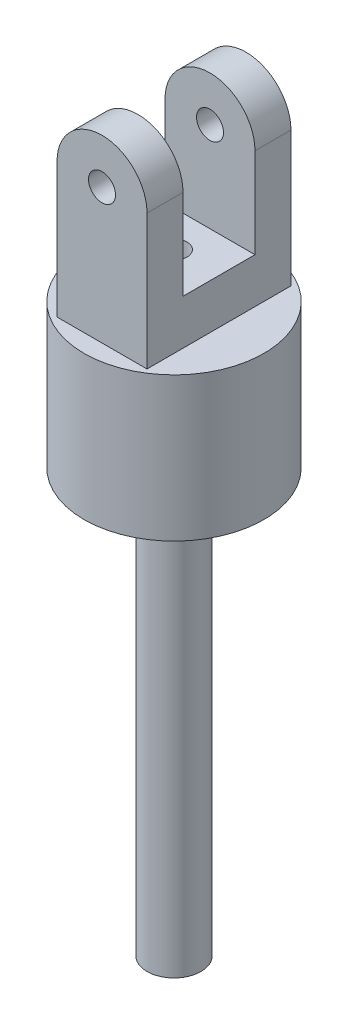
ISO-10303-21;
HEADER;
FILE_DESCRIPTION(('STEP AP214'),'2;1');
FILE_NAME('part.step','',(''),(''),'','','');
FILE_SCHEMA(('AUTOMOTIVE_DESIGN { 1 0 10303 214 1 1 1 1 }'));
ENDSEC;
DATA;
#1=APPLICATION_CONTEXT('core data for automotive mechanical design processes');
#2=APPLICATION_PROTOCOL_DEFINITION('international standard','automotive_design',2000,#1);
#3=PRODUCT_CONTEXT('',#1,'mechanical');
#4=PRODUCT('Part','Part','',(#3));
#5=PRODUCT_RELATED_PRODUCT_CATEGORY('part','',(#4));
#6=PRODUCT_DEFINITION_FORMATION('','',#4);
#7=PRODUCT_DEFINITION_CONTEXT('part definition',#1,'design');
#8=PRODUCT_DEFINITION('design','',#6,#7);
#9=PRODUCT_DEFINITION_SHAPE('','',#8);
#10=(LENGTH_UNIT() NAMED_UNIT(*) SI_UNIT(.MILLI.,.METRE.));
#11=(NAMED_UNIT(*) PLANE_ANGLE_UNIT() SI_UNIT($,.RADIAN.));
#12=(NAMED_UNIT(*) SI_UNIT($,.STERADIAN.) SOLID_ANGLE_UNIT());
#13=UNCERTAINTY_MEASURE_WITH_UNIT(LENGTH_MEASURE(1.E-05),#10,'distance_accuracy_value','');
#14=(GEOMETRIC_REPRESENTATION_CONTEXT(3) GLOBAL_UNCERTAINTY_ASSIGNED_CONTEXT((#13)) GLOBAL_UNIT_ASSIGNED_CONTEXT((#10,
#11,#12)) REPRESENTATION_CONTEXT('',''));
#15=CARTESIAN_POINT('',(0.,0.,0.));
#16=DIRECTION('',(0.,0.,1.));
#17=DIRECTION('',(1.,0.,0.));
#18=AXIS2_PLACEMENT_3D('',#15,#16,#17);
#19=CARTESIAN_POINT('',(0.,-9.,0.));
#20=DIRECTION('',(0.,-1.,0.));
#21=DIRECTION('',(0.,0.,-1.));
#22=AXIS2_PLACEMENT_3D('',#19,#20,#21);
#23=PLANE('',#22);
#24=CARTESIAN_POINT('',(-10.6521739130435,-9.,1.73913043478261));
#25=DIRECTION('',(0.,-1.,0.));
#26=DIRECTION('',(0.,0.,-1.));
#27=AXIS2_PLACEMENT_3D('',#24,#25,#26);
#28=CIRCLE('',#27,8.);
#29=CARTESIAN_POINT('',(-10.6521739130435,-9.,-6.26086956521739));
#30=VERTEX_POINT('',#29);
#31=EDGE_CURVE('E289',#30,#30,#28,.F.);
#32=ORIENTED_EDGE('',*,*,#31,.F.);
#33=EDGE_LOOP('',(#32));
#34=FACE_BOUND('',#33,.T.);
#35=CARTESIAN_POINT('',(-10.6521739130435,-9.,1.73913043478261));
#36=DIRECTION('',(0.,-1.,0.));
#37=DIRECTION('',(0.,0.,-1.));
#38=AXIS2_PLACEMENT_3D('',#35,#36,#37);
#39=CIRCLE('',#38,3.);
#40=CARTESIAN_POINT('',(-10.6521739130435,-9.,-1.26086956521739));
#41=VERTEX_POINT('',#40);
#42=EDGE_CURVE('E159',#41,#41,#39,.F.);
#43=ORIENTED_EDGE('',*,*,#42,.T.);
#44=EDGE_LOOP('',(#43));
#45=FACE_BOUND('',#44,.T.);
#46=ADVANCED_FACE('F79',(#34,#45),#23,.T.);
#47=CARTESIAN_POINT('',(0.,-68.,0.));
#48=DIRECTION('',(0.,-1.,0.));
#49=DIRECTION('',(0.,0.,-1.));
#50=AXIS2_PLACEMENT_3D('',#47,#48,#49);
#51=PLANE('',#50);
#52=CARTESIAN_POINT('',(-10.6521739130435,-68.,1.73913043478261));
#53=DIRECTION('',(0.,-1.,0.));
#54=DIRECTION('',(0.,0.,-1.));
#55=AXIS2_PLACEMENT_3D('',#52,#53,#54);
#56=CIRCLE('',#55,1.45);
#57=CARTESIAN_POINT('',(-10.6521739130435,-68.,0.289130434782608));
#58=VERTEX_POINT('',#57);
#59=EDGE_CURVE('E302',#58,#58,#56,.T.);
#60=ORIENTED_EDGE('',*,*,#59,.F.);
#61=EDGE_LOOP('',(#60));
#62=FACE_BOUND('',#61,.T.);
#63=CARTESIAN_POINT('',(-10.6521739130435,-68.,1.73913043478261));
#64=DIRECTION('',(0.,-1.,0.));
#65=DIRECTION('',(0.,0.,-1.));
#66=AXIS2_PLACEMENT_3D('',#63,#64,#65);
#67=CIRCLE('',#66,3.);
#68=CARTESIAN_POINT('',(-10.6521739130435,-68.,-1.26086956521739));
#69=VERTEX_POINT('',#68);
#70=EDGE_CURVE('E180',#69,#69,#67,.T.);
#71=ORIENTED_EDGE('',*,*,#70,.T.);
#72=EDGE_LOOP('',(#71));
#73=FACE_BOUND('',#72,.T.);
#74=ADVANCED_FACE('F263',(#62,#73),#51,.T.);
#75=CARTESIAN_POINT('',(-10.6521739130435,-68.,1.73913043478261));
#76=DIRECTION('',(0.,1.,0.));
#77=DIRECTION('',(0.,0.,1.));
#78=AXIS2_PLACEMENT_3D('',#75,#76,#77);
#79=CYLINDRICAL_SURFACE('',#78,3.);
#80=ORIENTED_EDGE('',*,*,#42,.F.);
#81=EDGE_LOOP('',(#80));
#82=FACE_BOUND('',#81,.T.);
#83=ORIENTED_EDGE('',*,*,#70,.F.);
#84=EDGE_LOOP('',(#83));
#85=FACE_BOUND('',#84,.T.);
#86=ADVANCED_FACE('F269',(#82,#85),#79,.T.);
#87=CARTESIAN_POINT('',(-10.6521739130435,-21.,1.73913043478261));
#88=DIRECTION('',(0.,1.,0.));
#89=DIRECTION('',(0.,0.,1.));
#90=AXIS2_PLACEMENT_3D('',#87,#88,#89);
#91=CYLINDRICAL_SURFACE('',#90,8.);
#92=ORIENTED_EDGE('',*,*,#31,.T.);
#93=EDGE_LOOP('',(#92));
#94=FACE_BOUND('',#93,.T.);
#95=CARTESIAN_POINT('',(-10.6521739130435,-21.,1.73913043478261));
#96=DIRECTION('',(0.,-1.,0.));
#97=DIRECTION('',(0.,0.,-1.));
#98=AXIS2_PLACEMENT_3D('',#95,#96,#97);
#99=CIRCLE('',#98,8.);
#100=CARTESIAN_POINT('',(-10.6521739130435,-21.,-6.26086956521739));
#101=VERTEX_POINT('',#100);
#102=EDGE_CURVE('E297',#101,#101,#99,.T.);
#103=ORIENTED_EDGE('',*,*,#102,.T.);
#104=EDGE_LOOP('',(#103));
#105=FACE_BOUND('',#104,.T.);
#106=ADVANCED_FACE('F275',(#94,#105),#91,.F.);
#107=CARTESIAN_POINT('',(-10.6521739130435,-21.,1.73913043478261));
#108=DIRECTION('',(0.,1.,0.));
#109=DIRECTION('',(0.,0.,1.));
#110=AXIS2_PLACEMENT_3D('',#107,#108,#109);
#111=CYLINDRICAL_SURFACE('',#110,10.);
#112=CARTESIAN_POINT('',(-10.6521739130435,-21.,1.73913043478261));
#113=DIRECTION('',(0.,-1.,0.));
#114=DIRECTION('',(0.,0.,-1.));
#115=AXIS2_PLACEMENT_3D('',#112,#113,#114);
#116=CIRCLE('',#115,10.);
#117=CARTESIAN_POINT('',(-10.6521739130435,-21.,-8.26086956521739));
#118=VERTEX_POINT('',#117);
#119=EDGE_CURVE('E291',#118,#118,#116,.T.);
#120=ORIENTED_EDGE('',*,*,#119,.F.);
#121=EDGE_LOOP('',(#120));
#122=FACE_BOUND('',#121,.T.);
#123=CARTESIAN_POINT('',(-10.6521739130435,-5.,1.73913043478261));
#124=DIRECTION('',(0.,-1.,0.));
#125=DIRECTION('',(0.,0.,-1.));
#126=AXIS2_PLACEMENT_3D('',#123,#124,#125);
#127=CIRCLE('',#126,10.);
#128=CARTESIAN_POINT('',(-10.6521739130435,-5.,-8.26086956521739));
#129=VERTEX_POINT('',#128);
#130=EDGE_CURVE('E294',#129,#129,#127,.T.);
#131=ORIENTED_EDGE('',*,*,#130,.T.);
#132=EDGE_LOOP('',(#131));
#133=FACE_BOUND('',#132,.T.);
#134=ADVANCED_FACE('F282',(#122,#133),#111,.T.);
#135=CARTESIAN_POINT('',(0.,-21.,0.));
#136=DIRECTION('',(0.,-1.,0.));
#137=DIRECTION('',(0.,0.,-1.));
#138=AXIS2_PLACEMENT_3D('',#135,#136,#137);
#139=PLANE('',#138);
#140=ORIENTED_EDGE('',*,*,#102,.F.);
#141=EDGE_LOOP('',(#140));
#142=FACE_BOUND('',#141,.T.);
#143=ORIENTED_EDGE('',*,*,#119,.T.);
#144=EDGE_LOOP('',(#143));
#145=FACE_BOUND('',#144,.T.);
#146=ADVANCED_FACE('F334',(#142,#145),#139,.T.);
#147=CARTESIAN_POINT('',(-10.6521739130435,10.,-13.3319373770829));
#148=DIRECTION('',(0.,0.,1.));
#149=DIRECTION('',(1.,0.,0.));
#150=AXIS2_PLACEMENT_3D('',#147,#148,#149);
#151=CYLINDRICAL_SURFACE('',#150,1.5);
#152=CARTESIAN_POINT('',(-10.6521739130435,10.,-6.26086956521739));
#153=DIRECTION('',(0.,0.,-1.));
#154=DIRECTION('',(-1.,0.,0.));
#155=AXIS2_PLACEMENT_3D('',#152,#153,#154);
#156=CIRCLE('',#155,1.5);
#157=CARTESIAN_POINT('',(-12.1521739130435,10.,-6.26086956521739));
#158=VERTEX_POINT('',#157);
#159=EDGE_CURVE('E195',#158,#158,#156,.F.);
#160=ORIENTED_EDGE('',*,*,#159,.F.);
#161=EDGE_LOOP('',(#160));
#162=FACE_BOUND('',#161,.T.);
#163=CARTESIAN_POINT('',(-10.6521739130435,10.,-2.26086956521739));
#164=DIRECTION('',(0.,0.,-1.));
#165=DIRECTION('',(-1.,0.,0.));
#166=AXIS2_PLACEMENT_3D('',#163,#164,#165);
#167=CIRCLE('',#166,1.5);
#168=CARTESIAN_POINT('',(-12.1521739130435,10.,-2.26086956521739));
#169=VERTEX_POINT('',#168);
#170=EDGE_CURVE('E203',#169,#169,#167,.T.);
#171=ORIENTED_EDGE('',*,*,#170,.F.);
#172=EDGE_LOOP('',(#171));
#173=FACE_BOUND('',#172,.T.);
#174=ADVANCED_FACE('F331',(#162,#173),#151,.F.);
#175=CARTESIAN_POINT('',(-10.6521739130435,10.,5.73913043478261));
#176=DIRECTION('',(0.,0.,-1.));
#177=DIRECTION('',(-1.,0.,0.));
#178=AXIS2_PLACEMENT_3D('',#175,#176,#177);
#179=CIRCLE('',#178,1.5);
#180=CARTESIAN_POINT('',(-12.1521739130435,10.,5.73913043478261));
#181=VERTEX_POINT('',#180);
#182=EDGE_CURVE('E202',#181,#181,#179,.T.);
#183=ORIENTED_EDGE('',*,*,#182,.T.);
#184=EDGE_LOOP('',(#183));
#185=FACE_BOUND('',#184,.T.);
#186=CARTESIAN_POINT('',(-10.6521739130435,10.,9.73913043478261));
#187=DIRECTION('',(0.,0.,1.));
#188=DIRECTION('',(1.,0.,0.));
#189=AXIS2_PLACEMENT_3D('',#186,#187,#188);
#190=CIRCLE('',#189,1.5);
#191=CARTESIAN_POINT('',(-9.15217391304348,10.,9.73913043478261));
#192=VERTEX_POINT('',#191);
#193=EDGE_CURVE('E188',#192,#192,#190,.T.);
#194=ORIENTED_EDGE('',*,*,#193,.T.);
#195=EDGE_LOOP('',(#194));
#196=FACE_BOUND('',#195,.T.);
#197=ADVANCED_FACE('F228',(#185,#196),#151,.F.);
#198=CARTESIAN_POINT('',(0.,15.,-2.26086956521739));
#199=DIRECTION('',(0.,0.,-1.));
#200=DIRECTION('',(-1.,0.,0.));
#201=AXIS2_PLACEMENT_3D('',#198,#199,#200);
#202=PLANE('',#201);
#203=ORIENTED_EDGE('',*,*,#170,.T.);
#204=EDGE_LOOP('',(#203));
#205=FACE_BOUND('',#204,.T.);
#206=DIRECTION('',(0.,-1.,0.));
#207=VECTOR('',#206,1.);
#208=CARTESIAN_POINT('',(-5.65217391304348,15.,-2.26086956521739));
#209=LINE('',#208,#207);
#210=CARTESIAN_POINT('',(-5.65217391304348,10.,-2.26086956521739));
#211=VERTEX_POINT('',#210);
#212=CARTESIAN_POINT('',(-5.65217391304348,0.,-2.26086956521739));
#213=VERTEX_POINT('',#212);
#214=EDGE_CURVE('E218',#211,#213,#209,.T.);
#215=ORIENTED_EDGE('',*,*,#214,.F.);
#216=CARTESIAN_POINT('',(-10.6521739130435,10.,-2.26086956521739));
#217=DIRECTION('',(0.,0.,-1.));
#218=DIRECTION('',(-1.,0.,0.));
#219=AXIS2_PLACEMENT_3D('',#216,#217,#218);
#220=CIRCLE('',#219,5.);
#221=CARTESIAN_POINT('',(-15.6521739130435,10.,-2.26086956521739));
#222=VERTEX_POINT('',#221);
#223=EDGE_CURVE('E200',#222,#211,#220,.T.);
#224=ORIENTED_EDGE('',*,*,#223,.F.);
#225=DIRECTION('',(0.,-1.,0.));
#226=VECTOR('',#225,1.);
#227=CARTESIAN_POINT('',(-15.6521739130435,15.,-2.26086956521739));
#228=LINE('',#227,#226);
#229=CARTESIAN_POINT('',(-15.6521739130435,0.,-2.26086956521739));
#230=VERTEX_POINT('',#229);
#231=EDGE_CURVE('E220',#222,#230,#228,.T.);
#232=ORIENTED_EDGE('',*,*,#231,.T.);
#233=DIRECTION('',(1.,0.,0.));
#234=VECTOR('',#233,1.);
#235=CARTESIAN_POINT('',(0.,0.,-2.26086956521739));
#236=LINE('',#235,#234);
#237=EDGE_CURVE('E214',#230,#213,#236,.T.);
#238=ORIENTED_EDGE('',*,*,#237,.T.);
#239=EDGE_LOOP('',(#215,#224,#232,#238));
#240=FACE_BOUND('',#239,.T.);
#241=ADVANCED_FACE('F245',(#205,#240),#202,.F.);
#242=CARTESIAN_POINT('',(0.,0.,0.));
#243=DIRECTION('',(0.,1.,0.));
#244=DIRECTION('',(0.,0.,1.));
#245=AXIS2_PLACEMENT_3D('',#242,#243,#244);
#246=PLANE('',#245);
#247=CARTESIAN_POINT('',(-10.6521739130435,0.,1.73913043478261));
#248=DIRECTION('',(0.,1.,0.));
#249=DIRECTION('',(0.,0.,1.));
#250=AXIS2_PLACEMENT_3D('',#247,#248,#249);
#251=CIRCLE('',#250,1.45);
#252=CARTESIAN_POINT('',(-10.6521739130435,0.,3.18913043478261));
#253=VERTEX_POINT('',#252);
#254=EDGE_CURVE('E83',#253,#253,#251,.T.);
#255=ORIENTED_EDGE('',*,*,#254,.F.);
#256=EDGE_LOOP('',(#255));
#257=FACE_BOUND('',#256,.T.);
#258=DIRECTION('',(1.,0.,0.));
#259=VECTOR('',#258,1.);
#260=CARTESIAN_POINT('',(0.,0.,5.73913043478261));
#261=LINE('',#260,#259);
#262=CARTESIAN_POINT('',(-15.6521739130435,0.,5.73913043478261));
#263=VERTEX_POINT('',#262);
#264=CARTESIAN_POINT('',(-5.65217391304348,0.,5.73913043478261));
#265=VERTEX_POINT('',#264);
#266=EDGE_CURVE('E206',#263,#265,#261,.T.);
#267=ORIENTED_EDGE('',*,*,#266,.T.);
#268=DIRECTION('',(0.,0.,1.));
#269=VECTOR('',#268,1.);
#270=CARTESIAN_POINT('',(-5.65217391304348,0.,0.));
#271=LINE('',#270,#269);
#272=EDGE_CURVE('E167',#213,#265,#271,.T.);
#273=ORIENTED_EDGE('',*,*,#272,.F.);
#274=ORIENTED_EDGE('',*,*,#237,.F.);
#275=DIRECTION('',(0.,0.,1.));
#276=VECTOR('',#275,1.);
#277=CARTESIAN_POINT('',(-15.6521739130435,0.,0.));
#278=LINE('',#277,#276);
#279=EDGE_CURVE('E210',#230,#263,#278,.T.);
#280=ORIENTED_EDGE('',*,*,#279,.T.);
#281=EDGE_LOOP('',(#267,#273,#274,#280));
#282=FACE_BOUND('',#281,.T.);
#283=ADVANCED_FACE('F234',(#257,#282),#246,.T.);
#284=CARTESIAN_POINT('',(0.,15.,5.73913043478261));
#285=DIRECTION('',(0.,0.,-1.));
#286=DIRECTION('',(-1.,0.,0.));
#287=AXIS2_PLACEMENT_3D('',#284,#285,#286);
#288=PLANE('',#287);
#289=ORIENTED_EDGE('',*,*,#182,.F.);
#290=EDGE_LOOP('',(#289));
#291=FACE_BOUND('',#290,.T.);
#292=CARTESIAN_POINT('',(-10.6521739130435,10.,5.73913043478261));
#293=DIRECTION('',(0.,0.,-1.));
#294=DIRECTION('',(-1.,0.,0.));
#295=AXIS2_PLACEMENT_3D('',#292,#293,#294);
#296=CIRCLE('',#295,5.);
#297=CARTESIAN_POINT('',(-15.6521739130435,10.,5.73913043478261));
#298=VERTEX_POINT('',#297);
#299=CARTESIAN_POINT('',(-5.65217391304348,10.,5.73913043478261));
#300=VERTEX_POINT('',#299);
#301=EDGE_CURVE('E198',#298,#300,#296,.T.);
#302=ORIENTED_EDGE('',*,*,#301,.T.);
#303=DIRECTION('',(0.,-1.,0.));
#304=VECTOR('',#303,1.);
#305=CARTESIAN_POINT('',(-5.65217391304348,15.,5.73913043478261));
#306=LINE('',#305,#304);
#307=EDGE_CURVE('E95',#300,#265,#306,.T.);
#308=ORIENTED_EDGE('',*,*,#307,.T.);
#309=ORIENTED_EDGE('',*,*,#266,.F.);
#310=DIRECTION('',(0.,-1.,0.));
#311=VECTOR('',#310,1.);
#312=CARTESIAN_POINT('',(-15.6521739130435,15.,5.73913043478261));
#313=LINE('',#312,#311);
#314=EDGE_CURVE('E103',#298,#263,#313,.T.);
#315=ORIENTED_EDGE('',*,*,#314,.F.);
#316=EDGE_LOOP('',(#302,#308,#309,#315));
#317=FACE_BOUND('',#316,.T.);
#318=ADVANCED_FACE('F231',(#291,#317),#288,.T.);
#319=CARTESIAN_POINT('',(-10.6521739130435,10.,-13.3319373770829));
#320=DIRECTION('',(0.,0.,1.));
#321=DIRECTION('',(1.,0.,0.));
#322=AXIS2_PLACEMENT_3D('',#319,#320,#321);
#323=CYLINDRICAL_SURFACE('',#322,5.);
#324=DIRECTION('',(0.,0.,1.));
#325=VECTOR('',#324,1.);
#326=CARTESIAN_POINT('',(-15.6521739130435,10.,-13.3319373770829));
#327=LINE('',#326,#325);
#328=CARTESIAN_POINT('',(-15.6521739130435,10.,9.73913043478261));
#329=VERTEX_POINT('',#328);
#330=EDGE_CURVE('E191',#298,#329,#327,.T.);
#331=ORIENTED_EDGE('',*,*,#330,.T.);
#332=CARTESIAN_POINT('',(-10.6521739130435,10.,9.73913043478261));
#333=DIRECTION('',(0.,0.,1.));
#334=DIRECTION('',(1.,0.,0.));
#335=AXIS2_PLACEMENT_3D('',#332,#333,#334);
#336=CIRCLE('',#335,5.);
#337=CARTESIAN_POINT('',(-5.65217391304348,10.,9.73913043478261));
#338=VERTEX_POINT('',#337);
#339=EDGE_CURVE('E165',#338,#329,#336,.T.);
#340=ORIENTED_EDGE('',*,*,#339,.F.);
#341=DIRECTION('',(0.,0.,1.));
#342=VECTOR('',#341,1.);
#343=CARTESIAN_POINT('',(-5.65217391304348,10.,-13.3319373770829));
#344=LINE('',#343,#342);
#345=EDGE_CURVE('E12',#300,#338,#344,.T.);
#346=ORIENTED_EDGE('',*,*,#345,.F.);
#347=ORIENTED_EDGE('',*,*,#301,.F.);
#348=EDGE_LOOP('',(#331,#340,#346,#347));
#349=FACE_BOUND('',#348,.T.);
#350=ADVANCED_FACE('F233',(#349),#323,.T.);
#351=ORIENTED_EDGE('',*,*,#223,.T.);
#352=DIRECTION('',(0.,0.,1.));
#353=VECTOR('',#352,1.);
#354=CARTESIAN_POINT('',(-5.65217391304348,10.,-13.3319373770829));
#355=LINE('',#354,#353);
#356=CARTESIAN_POINT('',(-5.65217391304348,10.,-6.26086956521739));
#357=VERTEX_POINT('',#356);
#358=EDGE_CURVE('E183',#357,#211,#355,.T.);
#359=ORIENTED_EDGE('',*,*,#358,.F.);
#360=CARTESIAN_POINT('',(-10.6521739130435,10.,-6.26086956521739));
#361=DIRECTION('',(0.,0.,-1.));
#362=DIRECTION('',(-1.,0.,0.));
#363=AXIS2_PLACEMENT_3D('',#360,#361,#362);
#364=CIRCLE('',#363,5.);
#365=CARTESIAN_POINT('',(-15.6521739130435,10.,-6.26086956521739));
#366=VERTEX_POINT('',#365);
#367=EDGE_CURVE('E186',#357,#366,#364,.F.);
#368=ORIENTED_EDGE('',*,*,#367,.T.);
#369=EDGE_CURVE('E189',#366,#222,#327,.T.);
#370=ORIENTED_EDGE('',*,*,#369,.T.);
#371=EDGE_LOOP('',(#351,#359,#368,#370));
#372=FACE_BOUND('',#371,.T.);
#373=ADVANCED_FACE('F252',(#372),#323,.T.);
#374=CARTESIAN_POINT('',(0.,-5.,0.));
#375=DIRECTION('',(0.,-1.,0.));
#376=DIRECTION('',(0.,0.,-1.));
#377=AXIS2_PLACEMENT_3D('',#374,#375,#376);
#378=PLANE('',#377);
#379=DIRECTION('',(0.,0.,-1.));
#380=VECTOR('',#379,1.);
#381=CARTESIAN_POINT('',(-15.6521739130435,-5.,9.73913043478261));
#382=LINE('',#381,#380);
#383=CARTESIAN_POINT('',(-15.6521739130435,-5.,9.73913043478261));
#384=VERTEX_POINT('',#383);
#385=CARTESIAN_POINT('',(-15.6521739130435,-5.,-6.26086956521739));
#386=VERTEX_POINT('',#385);
#387=EDGE_CURVE('E152',#384,#386,#382,.T.);
#388=ORIENTED_EDGE('',*,*,#387,.T.);
#389=DIRECTION('',(1.,0.,0.));
#390=VECTOR('',#389,1.);
#391=CARTESIAN_POINT('',(-15.6521739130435,-5.,-6.26086956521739));
#392=LINE('',#391,#390);
#393=CARTESIAN_POINT('',(-5.65217391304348,-5.,-6.26086956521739));
#394=VERTEX_POINT('',#393);
#395=EDGE_CURVE('E174',#386,#394,#392,.T.);
#396=ORIENTED_EDGE('',*,*,#395,.T.);
#397=DIRECTION('',(0.,0.,1.));
#398=VECTOR('',#397,1.);
#399=CARTESIAN_POINT('',(-5.65217391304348,-5.,-6.26086956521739));
#400=LINE('',#399,#398);
#401=CARTESIAN_POINT('',(-5.65217391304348,-5.,9.73913043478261));
#402=VERTEX_POINT('',#401);
#403=EDGE_CURVE('E155',#394,#402,#400,.T.);
#404=ORIENTED_EDGE('',*,*,#403,.T.);
#405=DIRECTION('',(-1.,0.,0.));
#406=VECTOR('',#405,1.);
#407=CARTESIAN_POINT('',(-5.65217391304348,-5.,9.73913043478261));
#408=LINE('',#407,#406);
#409=EDGE_CURVE('E147',#402,#384,#408,.T.);
#410=ORIENTED_EDGE('',*,*,#409,.T.);
#411=EDGE_LOOP('',(#388,#396,#404,#410));
#412=FACE_BOUND('',#411,.T.);
#413=ORIENTED_EDGE('',*,*,#130,.F.);
#414=EDGE_LOOP('',(#413));
#415=FACE_BOUND('',#414,.T.);
#416=ADVANCED_FACE('F149',(#412,#415),#378,.F.);
#417=CARTESIAN_POINT('',(-15.6521739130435,15.,0.));
#418=DIRECTION('',(1.,0.,0.));
#419=DIRECTION('',(0.,0.,-1.));
#420=AXIS2_PLACEMENT_3D('',#417,#418,#419);
#421=PLANE('',#420);
#422=ORIENTED_EDGE('',*,*,#369,.F.);
#423=DIRECTION('',(0.,-1.,0.));
#424=VECTOR('',#423,1.);
#425=CARTESIAN_POINT('',(-15.6521739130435,15.,-6.26086956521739));
#426=LINE('',#425,#424);
#427=EDGE_CURVE('E172',#366,#386,#426,.T.);
#428=ORIENTED_EDGE('',*,*,#427,.T.);
#429=ORIENTED_EDGE('',*,*,#387,.F.);
#430=DIRECTION('',(0.,1.,0.));
#431=VECTOR('',#430,1.);
#432=CARTESIAN_POINT('',(-15.6521739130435,-4.,9.73913043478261));
#433=LINE('',#432,#431);
#434=EDGE_CURVE('E163',#384,#329,#433,.T.);
#435=ORIENTED_EDGE('',*,*,#434,.T.);
#436=ORIENTED_EDGE('',*,*,#330,.F.);
#437=ORIENTED_EDGE('',*,*,#314,.T.);
#438=ORIENTED_EDGE('',*,*,#279,.F.);
#439=ORIENTED_EDGE('',*,*,#231,.F.);
#440=EDGE_LOOP('',(#422,#428,#429,#435,#436,#437,#438,#439));
#441=FACE_BOUND('',#440,.T.);
#442=ADVANCED_FACE('F170',(#441),#421,.F.);
#443=CARTESIAN_POINT('',(-5.65217391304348,15.,0.));
#444=DIRECTION('',(1.,0.,0.));
#445=DIRECTION('',(0.,0.,-1.));
#446=AXIS2_PLACEMENT_3D('',#443,#444,#445);
#447=PLANE('',#446);
#448=DIRECTION('',(0.,-1.,0.));
#449=VECTOR('',#448,1.);
#450=CARTESIAN_POINT('',(-5.65217391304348,15.,-6.26086956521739));
#451=LINE('',#450,#449);
#452=EDGE_CURVE('E88',#357,#394,#451,.T.);
#453=ORIENTED_EDGE('',*,*,#452,.F.);
#454=ORIENTED_EDGE('',*,*,#358,.T.);
#455=ORIENTED_EDGE('',*,*,#214,.T.);
#456=ORIENTED_EDGE('',*,*,#272,.T.);
#457=ORIENTED_EDGE('',*,*,#307,.F.);
#458=ORIENTED_EDGE('',*,*,#345,.T.);
#459=DIRECTION('',(0.,1.,0.));
#460=VECTOR('',#459,1.);
#461=CARTESIAN_POINT('',(-5.65217391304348,-4.,9.73913043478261));
#462=LINE('',#461,#460);
#463=EDGE_CURVE('E166',#402,#338,#462,.T.);
#464=ORIENTED_EDGE('',*,*,#463,.F.);
#465=ORIENTED_EDGE('',*,*,#403,.F.);
#466=EDGE_LOOP('',(#453,#454,#455,#456,#457,#458,#464,#465));
#467=FACE_BOUND('',#466,.T.);
#468=ADVANCED_FACE('F81',(#467),#447,.T.);
#469=CARTESIAN_POINT('',(0.,-4.,9.73913043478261));
#470=DIRECTION('',(0.,0.,1.));
#471=DIRECTION('',(1.,0.,0.));
#472=AXIS2_PLACEMENT_3D('',#469,#470,#471);
#473=PLANE('',#472);
#474=ORIENTED_EDGE('',*,*,#193,.F.);
#475=EDGE_LOOP('',(#474));
#476=FACE_BOUND('',#475,.T.);
#477=ORIENTED_EDGE('',*,*,#463,.T.);
#478=ORIENTED_EDGE('',*,*,#339,.T.);
#479=ORIENTED_EDGE('',*,*,#434,.F.);
#480=ORIENTED_EDGE('',*,*,#409,.F.);
#481=EDGE_LOOP('',(#477,#478,#479,#480));
#482=FACE_BOUND('',#481,.T.);
#483=ADVANCED_FACE('F164',(#476,#482),#473,.T.);
#484=CARTESIAN_POINT('',(0.,15.,-6.26086956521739));
#485=DIRECTION('',(0.,0.,-1.));
#486=DIRECTION('',(-1.,0.,0.));
#487=AXIS2_PLACEMENT_3D('',#484,#485,#486);
#488=PLANE('',#487);
#489=ORIENTED_EDGE('',*,*,#159,.T.);
#490=EDGE_LOOP('',(#489));
#491=FACE_BOUND('',#490,.T.);
#492=ORIENTED_EDGE('',*,*,#367,.F.);
#493=ORIENTED_EDGE('',*,*,#452,.T.);
#494=ORIENTED_EDGE('',*,*,#395,.F.);
#495=ORIENTED_EDGE('',*,*,#427,.F.);
#496=EDGE_LOOP('',(#492,#493,#494,#495));
#497=FACE_BOUND('',#496,.T.);
#498=ADVANCED_FACE('F250',(#491,#497),#488,.T.);
#499=CARTESIAN_POINT('',(-10.6521739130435,15.,1.73913043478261));
#500=DIRECTION('',(0.,-1.,0.));
#501=DIRECTION('',(0.,0.,-1.));
#502=AXIS2_PLACEMENT_3D('',#499,#500,#501);
#503=CYLINDRICAL_SURFACE('',#502,1.45);
#504=ORIENTED_EDGE('',*,*,#254,.T.);
#505=EDGE_LOOP('',(#504));
#506=FACE_BOUND('',#505,.T.);
#507=ORIENTED_EDGE('',*,*,#59,.T.);
#508=EDGE_LOOP('',(#507));
#509=FACE_BOUND('',#508,.T.);
#510=ADVANCED_FACE('F309',(#506,#509),#503,.F.);
#511=CLOSED_SHELL('',(#46,#74,#86,#106,#134,#146,#174,#197,#241,#283,#318,#350,#373,#416,#442,
#468,#483,#498,#510));
#512=MANIFOLD_SOLID_BREP('B2',#511);
#513=ADVANCED_BREP_SHAPE_REPRESENTATION('',(#18,#512),#14);
#514=SHAPE_DEFINITION_REPRESENTATION(#9,#513);
ENDSEC;
END-ISO-10303-21;
